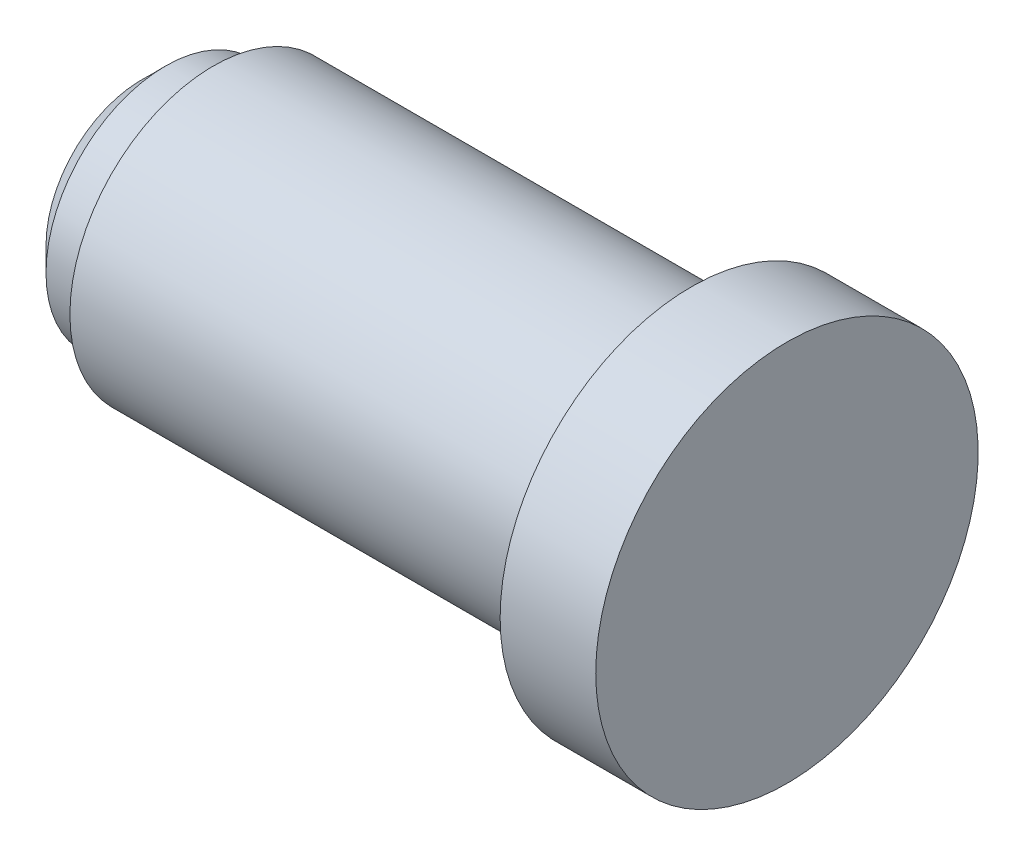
ISO-10303-21;
HEADER;
FILE_DESCRIPTION(('STEP AP214'),'2;1');
FILE_NAME('part.step','',(''),(''),'','','');
FILE_SCHEMA(('AUTOMOTIVE_DESIGN { 1 0 10303 214 1 1 1 1 }'));
ENDSEC;
DATA;
#1=APPLICATION_CONTEXT('core data for automotive mechanical design processes');
#2=APPLICATION_PROTOCOL_DEFINITION('international standard','automotive_design',2000,#1);
#3=PRODUCT_CONTEXT('',#1,'mechanical');
#4=PRODUCT('Part','Part','',(#3));
#5=PRODUCT_RELATED_PRODUCT_CATEGORY('part','',(#4));
#6=PRODUCT_DEFINITION_FORMATION('','',#4);
#7=PRODUCT_DEFINITION_CONTEXT('part definition',#1,'design');
#8=PRODUCT_DEFINITION('design','',#6,#7);
#9=PRODUCT_DEFINITION_SHAPE('','',#8);
#10=(LENGTH_UNIT() NAMED_UNIT(*) SI_UNIT(.MILLI.,.METRE.));
#11=(NAMED_UNIT(*) PLANE_ANGLE_UNIT() SI_UNIT($,.RADIAN.));
#12=(NAMED_UNIT(*) SI_UNIT($,.STERADIAN.) SOLID_ANGLE_UNIT());
#13=UNCERTAINTY_MEASURE_WITH_UNIT(LENGTH_MEASURE(1.E-05),#10,'distance_accuracy_value','');
#14=(GEOMETRIC_REPRESENTATION_CONTEXT(3) GLOBAL_UNCERTAINTY_ASSIGNED_CONTEXT((#13)) GLOBAL_UNIT_ASSIGNED_CONTEXT((#10,
#11,#12)) REPRESENTATION_CONTEXT('',''));
#15=CARTESIAN_POINT('',(0.,0.,0.));
#16=DIRECTION('',(0.,0.,1.));
#17=DIRECTION('',(1.,0.,0.));
#18=AXIS2_PLACEMENT_3D('',#15,#16,#17);
#19=CARTESIAN_POINT('',(-45.1981040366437,0.,0.));
#20=DIRECTION('',(1.,0.,0.));
#21=DIRECTION('',(0.,0.,-1.));
#22=AXIS2_PLACEMENT_3D('',#19,#20,#21);
#23=PLANE('',#22);
#24=CARTESIAN_POINT('',(-45.1981040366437,0.,0.));
#25=DIRECTION('',(-1.,0.,0.));
#26=DIRECTION('',(0.,0.,1.));
#27=AXIS2_PLACEMENT_3D('',#24,#25,#26);
#28=CIRCLE('',#27,2.);
#29=CARTESIAN_POINT('',(-45.1981040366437,0.,2.));
#30=VERTEX_POINT('',#29);
#31=EDGE_CURVE('E55',#30,#30,#28,.T.);
#32=ORIENTED_EDGE('',*,*,#31,.T.);
#33=EDGE_LOOP('',(#32));
#34=FACE_BOUND('',#33,.T.);
#35=ADVANCED_FACE('F30',(#34),#23,.F.);
#36=CARTESIAN_POINT('',(-31.6981040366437,0.,0.));
#37=DIRECTION('',(-1.,0.,0.));
#38=DIRECTION('',(0.,0.,1.));
#39=AXIS2_PLACEMENT_3D('',#36,#37,#38);
#40=PLANE('',#39);
#41=CARTESIAN_POINT('',(-31.6981040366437,0.,0.));
#42=DIRECTION('',(-1.,0.,0.));
#43=DIRECTION('',(0.,0.,1.));
#44=AXIS2_PLACEMENT_3D('',#41,#42,#43);
#45=CIRCLE('',#44,4.);
#46=CARTESIAN_POINT('',(-31.6981040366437,0.,4.));
#47=VERTEX_POINT('',#46);
#48=EDGE_CURVE('E10',#47,#47,#45,.T.);
#49=ORIENTED_EDGE('',*,*,#48,.F.);
#50=EDGE_LOOP('',(#49));
#51=FACE_BOUND('',#50,.T.);
#52=ADVANCED_FACE('F91',(#51),#40,.F.);
#53=CARTESIAN_POINT('',(-45.1981040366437,0.,0.));
#54=DIRECTION('',(-1.,0.,0.));
#55=DIRECTION('',(0.,0.,1.));
#56=AXIS2_PLACEMENT_3D('',#53,#54,#55);
#57=CYLINDRICAL_SURFACE('',#56,4.);
#58=CARTESIAN_POINT('',(-33.6981040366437,0.,0.));
#59=DIRECTION('',(-1.,0.,0.));
#60=DIRECTION('',(0.,0.,1.));
#61=AXIS2_PLACEMENT_3D('',#58,#59,#60);
#62=CIRCLE('',#61,4.);
#63=CARTESIAN_POINT('',(-33.6981040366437,0.,4.));
#64=VERTEX_POINT('',#63);
#65=EDGE_CURVE('E36',#64,#64,#62,.T.);
#66=ORIENTED_EDGE('',*,*,#65,.F.);
#67=EDGE_LOOP('',(#66));
#68=FACE_BOUND('',#67,.T.);
#69=ORIENTED_EDGE('',*,*,#48,.T.);
#70=EDGE_LOOP('',(#69));
#71=FACE_BOUND('',#70,.T.);
#72=ADVANCED_FACE('F86',(#68,#71),#57,.T.);
#73=CARTESIAN_POINT('',(-33.6981040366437,4.,0.));
#74=DIRECTION('',(1.,0.,0.));
#75=DIRECTION('',(0.,0.,-1.));
#76=AXIS2_PLACEMENT_3D('',#73,#74,#75);
#77=PLANE('',#76);
#78=CARTESIAN_POINT('',(-33.6981040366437,0.,0.));
#79=DIRECTION('',(-1.,0.,0.));
#80=DIRECTION('',(0.,0.,1.));
#81=AXIS2_PLACEMENT_3D('',#78,#79,#80);
#82=CIRCLE('',#81,3.);
#83=CARTESIAN_POINT('',(-33.6981040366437,0.,3.));
#84=VERTEX_POINT('',#83);
#85=EDGE_CURVE('E40',#84,#84,#82,.T.);
#86=ORIENTED_EDGE('',*,*,#85,.F.);
#87=EDGE_LOOP('',(#86));
#88=FACE_BOUND('',#87,.T.);
#89=ORIENTED_EDGE('',*,*,#65,.T.);
#90=EDGE_LOOP('',(#89));
#91=FACE_BOUND('',#90,.T.);
#92=ADVANCED_FACE('F81',(#88,#91),#77,.F.);
#93=CARTESIAN_POINT('',(-45.1981040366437,0.,0.));
#94=DIRECTION('',(-1.,0.,0.));
#95=DIRECTION('',(0.,0.,1.));
#96=AXIS2_PLACEMENT_3D('',#93,#94,#95);
#97=CYLINDRICAL_SURFACE('',#96,3.);
#98=CARTESIAN_POINT('',(-43.6981040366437,0.,0.));
#99=DIRECTION('',(-1.,0.,0.));
#100=DIRECTION('',(0.,0.,1.));
#101=AXIS2_PLACEMENT_3D('',#98,#99,#100);
#102=CIRCLE('',#101,3.);
#103=CARTESIAN_POINT('',(-43.6981040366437,0.,3.));
#104=VERTEX_POINT('',#103);
#105=EDGE_CURVE('E44',#104,#104,#102,.T.);
#106=ORIENTED_EDGE('',*,*,#105,.F.);
#107=EDGE_LOOP('',(#106));
#108=FACE_BOUND('',#107,.T.);
#109=ORIENTED_EDGE('',*,*,#85,.T.);
#110=EDGE_LOOP('',(#109));
#111=FACE_BOUND('',#110,.T.);
#112=ADVANCED_FACE('F75',(#108,#111),#97,.T.);
#113=CARTESIAN_POINT('',(-43.6981040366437,3.,0.));
#114=DIRECTION('',(1.,0.,0.));
#115=DIRECTION('',(0.,0.,-1.));
#116=AXIS2_PLACEMENT_3D('',#113,#114,#115);
#117=PLANE('',#116);
#118=CARTESIAN_POINT('',(-43.6981040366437,0.,0.));
#119=DIRECTION('',(-1.,0.,0.));
#120=DIRECTION('',(0.,0.,1.));
#121=AXIS2_PLACEMENT_3D('',#118,#119,#120);
#122=CIRCLE('',#121,2.5);
#123=CARTESIAN_POINT('',(-43.6981040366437,0.,2.5));
#124=VERTEX_POINT('',#123);
#125=EDGE_CURVE('E49',#124,#124,#122,.T.);
#126=ORIENTED_EDGE('',*,*,#125,.F.);
#127=EDGE_LOOP('',(#126));
#128=FACE_BOUND('',#127,.T.);
#129=ORIENTED_EDGE('',*,*,#105,.T.);
#130=EDGE_LOOP('',(#129));
#131=FACE_BOUND('',#130,.T.);
#132=ADVANCED_FACE('F69',(#128,#131),#117,.F.);
#133=CARTESIAN_POINT('',(-45.1981040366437,0.,0.));
#134=DIRECTION('',(-1.,0.,0.));
#135=DIRECTION('',(0.,0.,1.));
#136=AXIS2_PLACEMENT_3D('',#133,#134,#135);
#137=CYLINDRICAL_SURFACE('',#136,2.5);
#138=CARTESIAN_POINT('',(-44.6981040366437,0.,0.));
#139=DIRECTION('',(-1.,0.,0.));
#140=DIRECTION('',(0.,0.,1.));
#141=AXIS2_PLACEMENT_3D('',#138,#139,#140);
#142=CIRCLE('',#141,2.5);
#143=CARTESIAN_POINT('',(-44.6981040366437,0.,2.5));
#144=VERTEX_POINT('',#143);
#145=EDGE_CURVE('E52',#144,#144,#142,.T.);
#146=ORIENTED_EDGE('',*,*,#145,.F.);
#147=EDGE_LOOP('',(#146));
#148=FACE_BOUND('',#147,.T.);
#149=ORIENTED_EDGE('',*,*,#125,.T.);
#150=EDGE_LOOP('',(#149));
#151=FACE_BOUND('',#150,.T.);
#152=ADVANCED_FACE('F63',(#148,#151),#137,.T.);
#153=CARTESIAN_POINT('',(-44.6981040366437,0.,0.));
#154=DIRECTION('',(1.,0.,0.));
#155=DIRECTION('',(0.,0.,-1.));
#156=AXIS2_PLACEMENT_3D('',#153,#154,#155);
#157=CONICAL_SURFACE('',#156,2.5,0.785398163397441);
#158=ORIENTED_EDGE('',*,*,#31,.F.);
#159=EDGE_LOOP('',(#158));
#160=FACE_BOUND('',#159,.T.);
#161=ORIENTED_EDGE('',*,*,#145,.T.);
#162=EDGE_LOOP('',(#161));
#163=FACE_BOUND('',#162,.T.);
#164=ADVANCED_FACE('F60',(#160,#163),#157,.T.);
#165=CLOSED_SHELL('',(#35,#52,#72,#92,#112,#132,#152,#164));
#166=MANIFOLD_SOLID_BREP('B2',#165);
#167=ADVANCED_BREP_SHAPE_REPRESENTATION('',(#18,#166),#14);
#168=SHAPE_DEFINITION_REPRESENTATION(#9,#167);
ENDSEC;
END-ISO-10303-21;
